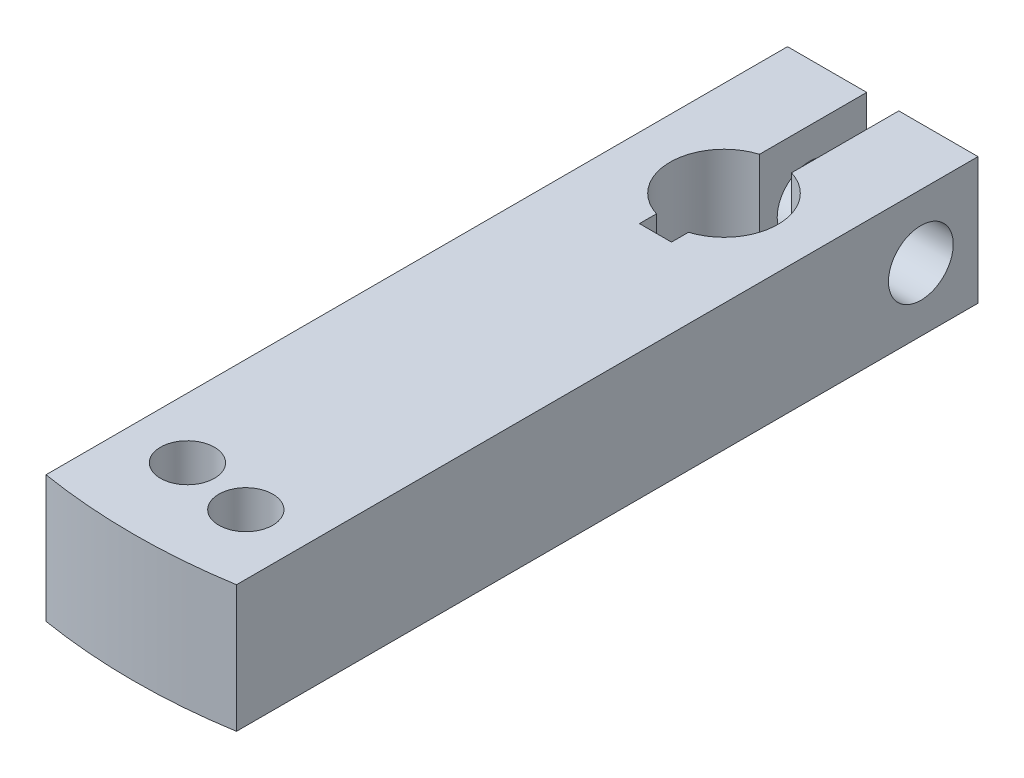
ISO-10303-21;
HEADER;
FILE_DESCRIPTION(('STEP AP214'),'2;1');
FILE_NAME('part.step','',(''),(''),'','','');
FILE_SCHEMA(('AUTOMOTIVE_DESIGN { 1 0 10303 214 1 1 1 1 }'));
ENDSEC;
DATA;
#1=APPLICATION_CONTEXT('core data for automotive mechanical design processes');
#2=APPLICATION_PROTOCOL_DEFINITION('international standard','automotive_design',2000,#1);
#3=PRODUCT_CONTEXT('',#1,'mechanical');
#4=PRODUCT('Part','Part','',(#3));
#5=PRODUCT_RELATED_PRODUCT_CATEGORY('part','',(#4));
#6=PRODUCT_DEFINITION_FORMATION('','',#4);
#7=PRODUCT_DEFINITION_CONTEXT('part definition',#1,'design');
#8=PRODUCT_DEFINITION('design','',#6,#7);
#9=PRODUCT_DEFINITION_SHAPE('','',#8);
#10=(LENGTH_UNIT() NAMED_UNIT(*) SI_UNIT(.MILLI.,.METRE.));
#11=(NAMED_UNIT(*) PLANE_ANGLE_UNIT() SI_UNIT($,.RADIAN.));
#12=(NAMED_UNIT(*) SI_UNIT($,.STERADIAN.) SOLID_ANGLE_UNIT());
#13=UNCERTAINTY_MEASURE_WITH_UNIT(LENGTH_MEASURE(1.E-05),#10,'distance_accuracy_value','');
#14=(GEOMETRIC_REPRESENTATION_CONTEXT(3) GLOBAL_UNCERTAINTY_ASSIGNED_CONTEXT((#13)) GLOBAL_UNIT_ASSIGNED_CONTEXT((#10,
#11,#12)) REPRESENTATION_CONTEXT('',''));
#15=CARTESIAN_POINT('',(0.,0.,0.));
#16=DIRECTION('',(0.,0.,1.));
#17=DIRECTION('',(1.,0.,0.));
#18=AXIS2_PLACEMENT_3D('',#15,#16,#17);
#19=CARTESIAN_POINT('',(15.0000000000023,-10.,-25.));
#20=DIRECTION('',(-1.,0.,0.));
#21=DIRECTION('',(0.,0.,1.));
#22=AXIS2_PLACEMENT_3D('',#19,#20,#21);
#23=PLANE('',#22);
#24=CARTESIAN_POINT('',(15.0000000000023,0.,-16.));
#25=DIRECTION('',(-1.,0.,0.));
#26=DIRECTION('',(0.,0.,1.));
#27=AXIS2_PLACEMENT_3D('',#24,#25,#26);
#28=CIRCLE('',#27,5.1);
#29=CARTESIAN_POINT('',(15.0000000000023,0.,-10.9));
#30=VERTEX_POINT('',#29);
#31=EDGE_CURVE('E140',#30,#30,#28,.T.);
#32=ORIENTED_EDGE('',*,*,#31,.T.);
#33=EDGE_LOOP('',(#32));
#34=FACE_BOUND('',#33,.T.);
#35=DIRECTION('',(0.,0.,1.));
#36=VECTOR('',#35,1.);
#37=CARTESIAN_POINT('',(15.0000000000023,9.99999999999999,-25.));
#38=LINE('',#37,#36);
#39=CARTESIAN_POINT('',(15.0000000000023,9.99999999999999,-25.));
#40=VERTEX_POINT('',#39);
#41=CARTESIAN_POINT('',(15.0000000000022,10.,91.7823512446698));
#42=VERTEX_POINT('',#41);
#43=EDGE_CURVE('E143',#40,#42,#38,.T.);
#44=ORIENTED_EDGE('',*,*,#43,.T.);
#45=DIRECTION('',(0.,1.,0.));
#46=VECTOR('',#45,1.);
#47=CARTESIAN_POINT('',(15.0000000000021,-10.,91.7823512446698));
#48=LINE('',#47,#46);
#49=CARTESIAN_POINT('',(15.0000000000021,-10.,91.7823512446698));
#50=VERTEX_POINT('',#49);
#51=EDGE_CURVE('E11',#50,#42,#48,.T.);
#52=ORIENTED_EDGE('',*,*,#51,.F.);
#53=DIRECTION('',(0.,0.,1.));
#54=VECTOR('',#53,1.);
#55=CARTESIAN_POINT('',(15.0000000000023,-10.,-25.));
#56=LINE('',#55,#54);
#57=CARTESIAN_POINT('',(15.0000000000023,-10.,-25.));
#58=VERTEX_POINT('',#57);
#59=EDGE_CURVE('E177',#58,#50,#56,.T.);
#60=ORIENTED_EDGE('',*,*,#59,.F.);
#61=DIRECTION('',(0.,1.,0.));
#62=VECTOR('',#61,1.);
#63=CARTESIAN_POINT('',(15.0000000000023,-10.,-25.));
#64=LINE('',#63,#62);
#65=EDGE_CURVE('E202',#58,#40,#64,.T.);
#66=ORIENTED_EDGE('',*,*,#65,.T.);
#67=EDGE_LOOP('',(#44,#52,#60,#66));
#68=FACE_BOUND('',#67,.T.);
#69=ADVANCED_FACE('F17',(#34,#68),#23,.F.);
#70=CARTESIAN_POINT('',(0.,-10.,0.));
#71=DIRECTION('',(0.,1.,0.));
#72=DIRECTION('',(0.,0.,1.));
#73=AXIS2_PLACEMENT_3D('',#70,#71,#72);
#74=CYLINDRICAL_SURFACE('',#73,93.);
#75=CARTESIAN_POINT('',(0.,9.99999999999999,0.));
#76=DIRECTION('',(0.,-1.,0.));
#77=DIRECTION('',(1.,0.,0.));
#78=AXIS2_PLACEMENT_3D('',#75,#76,#77);
#79=CIRCLE('',#78,93.);
#80=CARTESIAN_POINT('',(-14.999999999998,9.99999999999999,91.7823512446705));
#81=VERTEX_POINT('',#80);
#82=EDGE_CURVE('E144',#42,#81,#79,.T.);
#83=ORIENTED_EDGE('',*,*,#82,.T.);
#84=DIRECTION('',(0.,1.,0.));
#85=VECTOR('',#84,1.);
#86=CARTESIAN_POINT('',(-14.9999999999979,-10.,91.7823512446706));
#87=LINE('',#86,#85);
#88=CARTESIAN_POINT('',(-14.9999999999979,-10.,91.7823512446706));
#89=VERTEX_POINT('',#88);
#90=EDGE_CURVE('E25',#89,#81,#87,.T.);
#91=ORIENTED_EDGE('',*,*,#90,.F.);
#92=CARTESIAN_POINT('',(0.,-10.,0.));
#93=DIRECTION('',(0.,-1.,0.));
#94=DIRECTION('',(1.,0.,0.));
#95=AXIS2_PLACEMENT_3D('',#92,#93,#94);
#96=CIRCLE('',#95,93.);
#97=EDGE_CURVE('E181',#50,#89,#96,.T.);
#98=ORIENTED_EDGE('',*,*,#97,.F.);
#99=ORIENTED_EDGE('',*,*,#51,.T.);
#100=EDGE_LOOP('',(#83,#91,#98,#99));
#101=FACE_BOUND('',#100,.T.);
#102=ADVANCED_FACE('F259',(#101),#74,.T.);
#103=CARTESIAN_POINT('',(-14.9999999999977,-10.,-25.));
#104=DIRECTION('',(1.,0.,0.));
#105=DIRECTION('',(0.,0.,-1.));
#106=AXIS2_PLACEMENT_3D('',#103,#104,#105);
#107=PLANE('',#106);
#108=CARTESIAN_POINT('',(-14.9999999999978,0.,-15.9999999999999));
#109=DIRECTION('',(1.,0.,0.));
#110=DIRECTION('',(0.,0.,-1.));
#111=AXIS2_PLACEMENT_3D('',#108,#109,#110);
#112=CIRCLE('',#111,5.1);
#113=CARTESIAN_POINT('',(-14.9999999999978,0.,-21.0999999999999));
#114=VERTEX_POINT('',#113);
#115=EDGE_CURVE('E137',#114,#114,#112,.T.);
#116=ORIENTED_EDGE('',*,*,#115,.T.);
#117=EDGE_LOOP('',(#116));
#118=FACE_BOUND('',#117,.T.);
#119=DIRECTION('',(0.,0.,-1.));
#120=VECTOR('',#119,1.);
#121=CARTESIAN_POINT('',(-14.9999999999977,10.,-25.));
#122=LINE('',#121,#120);
#123=CARTESIAN_POINT('',(-14.9999999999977,10.,-25.));
#124=VERTEX_POINT('',#123);
#125=EDGE_CURVE('E147',#81,#124,#122,.T.);
#126=ORIENTED_EDGE('',*,*,#125,.T.);
#127=DIRECTION('',(0.,1.,0.));
#128=VECTOR('',#127,1.);
#129=CARTESIAN_POINT('',(-14.9999999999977,-10.,-25.));
#130=LINE('',#129,#128);
#131=CARTESIAN_POINT('',(-14.9999999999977,-10.,-25.));
#132=VERTEX_POINT('',#131);
#133=EDGE_CURVE('E230',#132,#124,#130,.T.);
#134=ORIENTED_EDGE('',*,*,#133,.F.);
#135=DIRECTION('',(0.,0.,-1.));
#136=VECTOR('',#135,1.);
#137=CARTESIAN_POINT('',(-14.9999999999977,-10.,-25.));
#138=LINE('',#137,#136);
#139=EDGE_CURVE('E183',#89,#132,#138,.T.);
#140=ORIENTED_EDGE('',*,*,#139,.F.);
#141=ORIENTED_EDGE('',*,*,#90,.T.);
#142=EDGE_LOOP('',(#126,#134,#140,#141));
#143=FACE_BOUND('',#142,.T.);
#144=ADVANCED_FACE('F238',(#118,#143),#107,.F.);
#145=CARTESIAN_POINT('',(-14.9999999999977,-10.,-25.));
#146=DIRECTION('',(0.,0.,1.));
#147=DIRECTION('',(1.,0.,0.));
#148=AXIS2_PLACEMENT_3D('',#145,#146,#147);
#149=PLANE('',#148);
#150=DIRECTION('',(1.,0.,0.));
#151=VECTOR('',#150,1.);
#152=CARTESIAN_POINT('',(-14.9999999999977,10.,-25.));
#153=LINE('',#152,#151);
#154=CARTESIAN_POINT('',(-2.525,10.,-25.));
#155=VERTEX_POINT('',#154);
#156=EDGE_CURVE('E150',#124,#155,#153,.T.);
#157=ORIENTED_EDGE('',*,*,#156,.T.);
#158=DIRECTION('',(0.,1.,0.));
#159=VECTOR('',#158,1.);
#160=CARTESIAN_POINT('',(-2.525,-9.99999999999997,-25.));
#161=LINE('',#160,#159);
#162=CARTESIAN_POINT('',(-2.525,-9.99999999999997,-25.));
#163=VERTEX_POINT('',#162);
#164=EDGE_CURVE('E227',#163,#155,#161,.T.);
#165=ORIENTED_EDGE('',*,*,#164,.F.);
#166=DIRECTION('',(1.,0.,0.));
#167=VECTOR('',#166,1.);
#168=CARTESIAN_POINT('',(-14.9999999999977,-10.,-25.));
#169=LINE('',#168,#167);
#170=EDGE_CURVE('E185',#132,#163,#169,.T.);
#171=ORIENTED_EDGE('',*,*,#170,.F.);
#172=ORIENTED_EDGE('',*,*,#133,.T.);
#173=EDGE_LOOP('',(#157,#165,#171,#172));
#174=FACE_BOUND('',#173,.T.);
#175=ADVANCED_FACE('F249',(#174),#149,.F.);
#176=CARTESIAN_POINT('',(-2.525,-9.99999999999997,-25.));
#177=DIRECTION('',(-1.,0.,0.));
#178=DIRECTION('',(0.,0.,1.));
#179=AXIS2_PLACEMENT_3D('',#176,#177,#178);
#180=PLANE('',#179);
#181=CARTESIAN_POINT('',(-2.525,0.,-16.));
#182=DIRECTION('',(-1.,0.,0.));
#183=DIRECTION('',(0.,0.,1.));
#184=AXIS2_PLACEMENT_3D('',#181,#182,#183);
#185=CIRCLE('',#184,5.1);
#186=CARTESIAN_POINT('',(-2.52500000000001,0.,-10.9));
#187=VERTEX_POINT('',#186);
#188=EDGE_CURVE('E134',#187,#187,#185,.T.);
#189=ORIENTED_EDGE('',*,*,#188,.T.);
#190=EDGE_LOOP('',(#189));
#191=FACE_BOUND('',#190,.T.);
#192=DIRECTION('',(0.,0.,1.));
#193=VECTOR('',#192,1.);
#194=CARTESIAN_POINT('',(-2.525,10.,-25.));
#195=LINE('',#194,#193);
#196=CARTESIAN_POINT('',(-2.525,9.99999999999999,-8.11630303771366));
#197=VERTEX_POINT('',#196);
#198=EDGE_CURVE('E153',#155,#197,#195,.T.);
#199=ORIENTED_EDGE('',*,*,#198,.T.);
#200=DIRECTION('',(0.,1.,0.));
#201=VECTOR('',#200,1.);
#202=CARTESIAN_POINT('',(-2.525,-10.,-8.11630303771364));
#203=LINE('',#202,#201);
#204=CARTESIAN_POINT('',(-2.525,-10.,-8.11630303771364));
#205=VERTEX_POINT('',#204);
#206=EDGE_CURVE('E224',#205,#197,#203,.T.);
#207=ORIENTED_EDGE('',*,*,#206,.F.);
#208=DIRECTION('',(0.,0.,1.));
#209=VECTOR('',#208,1.);
#210=CARTESIAN_POINT('',(-2.525,-9.99999999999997,-25.));
#211=LINE('',#210,#209);
#212=EDGE_CURVE('E187',#163,#205,#211,.T.);
#213=ORIENTED_EDGE('',*,*,#212,.F.);
#214=ORIENTED_EDGE('',*,*,#164,.T.);
#215=EDGE_LOOP('',(#199,#207,#213,#214));
#216=FACE_BOUND('',#215,.T.);
#217=ADVANCED_FACE('F253',(#191,#216),#180,.F.);
#218=CARTESIAN_POINT('',(0.,-10.,0.));
#219=DIRECTION('',(0.,1.,0.));
#220=DIRECTION('',(0.,0.,1.));
#221=AXIS2_PLACEMENT_3D('',#218,#219,#220);
#222=CYLINDRICAL_SURFACE('',#221,8.5);
#223=CARTESIAN_POINT('',(0.,9.99999999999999,0.));
#224=DIRECTION('',(0.,1.,0.));
#225=DIRECTION('',(1.,0.,0.));
#226=AXIS2_PLACEMENT_3D('',#223,#224,#225);
#227=CIRCLE('',#226,8.5);
#228=CARTESIAN_POINT('',(-2.52500000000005,10.,8.11630303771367));
#229=VERTEX_POINT('',#228);
#230=EDGE_CURVE('E156',#197,#229,#227,.T.);
#231=ORIENTED_EDGE('',*,*,#230,.T.);
#232=DIRECTION('',(0.,1.,0.));
#233=VECTOR('',#232,1.);
#234=CARTESIAN_POINT('',(-2.52500000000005,-10.,8.11630303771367));
#235=LINE('',#234,#233);
#236=CARTESIAN_POINT('',(-2.52500000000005,-10.,8.11630303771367));
#237=VERTEX_POINT('',#236);
#238=EDGE_CURVE('E221',#237,#229,#235,.T.);
#239=ORIENTED_EDGE('',*,*,#238,.F.);
#240=CARTESIAN_POINT('',(0.,-10.,0.));
#241=DIRECTION('',(0.,1.,0.));
#242=DIRECTION('',(1.,0.,0.));
#243=AXIS2_PLACEMENT_3D('',#240,#241,#242);
#244=CIRCLE('',#243,8.5);
#245=EDGE_CURVE('E189',#205,#237,#244,.T.);
#246=ORIENTED_EDGE('',*,*,#245,.F.);
#247=ORIENTED_EDGE('',*,*,#206,.T.);
#248=EDGE_LOOP('',(#231,#239,#246,#247));
#249=FACE_BOUND('',#248,.T.);
#250=ADVANCED_FACE('F290',(#249),#222,.F.);
#251=CARTESIAN_POINT('',(-2.52500000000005,-10.,10.8));
#252=DIRECTION('',(-1.,0.,0.));
#253=DIRECTION('',(0.,0.,1.));
#254=AXIS2_PLACEMENT_3D('',#251,#252,#253);
#255=PLANE('',#254);
#256=DIRECTION('',(0.,0.,1.));
#257=VECTOR('',#256,1.);
#258=CARTESIAN_POINT('',(-2.52500000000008,9.99999999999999,10.8));
#259=LINE('',#258,#257);
#260=CARTESIAN_POINT('',(-2.52500000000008,9.99999999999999,10.8));
#261=VERTEX_POINT('',#260);
#262=EDGE_CURVE('E159',#229,#261,#259,.T.);
#263=ORIENTED_EDGE('',*,*,#262,.T.);
#264=DIRECTION('',(0.,1.,0.));
#265=VECTOR('',#264,1.);
#266=CARTESIAN_POINT('',(-2.52500000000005,-10.,10.8));
#267=LINE('',#266,#265);
#268=CARTESIAN_POINT('',(-2.52500000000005,-10.,10.8));
#269=VERTEX_POINT('',#268);
#270=EDGE_CURVE('E218',#269,#261,#267,.T.);
#271=ORIENTED_EDGE('',*,*,#270,.F.);
#272=DIRECTION('',(0.,0.,1.));
#273=VECTOR('',#272,1.);
#274=CARTESIAN_POINT('',(-2.52500000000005,-10.,10.8));
#275=LINE('',#274,#273);
#276=EDGE_CURVE('E191',#237,#269,#275,.T.);
#277=ORIENTED_EDGE('',*,*,#276,.F.);
#278=ORIENTED_EDGE('',*,*,#238,.T.);
#279=EDGE_LOOP('',(#263,#271,#277,#278));
#280=FACE_BOUND('',#279,.T.);
#281=ADVANCED_FACE('F288',(#280),#255,.F.);
#282=CARTESIAN_POINT('',(-2.52500000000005,-10.,10.8));
#283=DIRECTION('',(0.,0.,1.));
#284=DIRECTION('',(1.,0.,0.));
#285=AXIS2_PLACEMENT_3D('',#282,#283,#284);
#286=PLANE('',#285);
#287=DIRECTION('',(1.,0.,0.));
#288=VECTOR('',#287,1.);
#289=CARTESIAN_POINT('',(-2.52500000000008,9.99999999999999,10.8));
#290=LINE('',#289,#288);
#291=CARTESIAN_POINT('',(2.52499999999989,9.99999999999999,10.8));
#292=VERTEX_POINT('',#291);
#293=EDGE_CURVE('E162',#261,#292,#290,.T.);
#294=ORIENTED_EDGE('',*,*,#293,.T.);
#295=DIRECTION('',(0.,1.,0.));
#296=VECTOR('',#295,1.);
#297=CARTESIAN_POINT('',(2.52499999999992,-10.,10.8));
#298=LINE('',#297,#296);
#299=CARTESIAN_POINT('',(2.52499999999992,-10.,10.8));
#300=VERTEX_POINT('',#299);
#301=EDGE_CURVE('E215',#300,#292,#298,.T.);
#302=ORIENTED_EDGE('',*,*,#301,.F.);
#303=DIRECTION('',(1.,0.,0.));
#304=VECTOR('',#303,1.);
#305=CARTESIAN_POINT('',(-2.52500000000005,-10.,10.8));
#306=LINE('',#305,#304);
#307=EDGE_CURVE('E193',#269,#300,#306,.T.);
#308=ORIENTED_EDGE('',*,*,#307,.F.);
#309=ORIENTED_EDGE('',*,*,#270,.T.);
#310=EDGE_LOOP('',(#294,#302,#308,#309));
#311=FACE_BOUND('',#310,.T.);
#312=ADVANCED_FACE('F284',(#311),#286,.F.);
#313=CARTESIAN_POINT('',(2.52499999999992,-10.,10.8));
#314=DIRECTION('',(1.,0.,0.));
#315=DIRECTION('',(0.,0.,-1.));
#316=AXIS2_PLACEMENT_3D('',#313,#314,#315);
#317=PLANE('',#316);
#318=DIRECTION('',(0.,0.,-1.));
#319=VECTOR('',#318,1.);
#320=CARTESIAN_POINT('',(2.52499999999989,9.99999999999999,10.8));
#321=LINE('',#320,#319);
#322=CARTESIAN_POINT('',(2.52499999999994,9.99999999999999,8.11630303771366));
#323=VERTEX_POINT('',#322);
#324=EDGE_CURVE('E165',#292,#323,#321,.T.);
#325=ORIENTED_EDGE('',*,*,#324,.T.);
#326=DIRECTION('',(0.,1.,0.));
#327=VECTOR('',#326,1.);
#328=CARTESIAN_POINT('',(2.52499999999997,-10.,8.11630303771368));
#329=LINE('',#328,#327);
#330=CARTESIAN_POINT('',(2.52499999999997,-10.,8.11630303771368));
#331=VERTEX_POINT('',#330);
#332=EDGE_CURVE('E212',#331,#323,#329,.T.);
#333=ORIENTED_EDGE('',*,*,#332,.F.);
#334=DIRECTION('',(0.,0.,-1.));
#335=VECTOR('',#334,1.);
#336=CARTESIAN_POINT('',(2.52499999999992,-10.,10.8));
#337=LINE('',#336,#335);
#338=EDGE_CURVE('E195',#300,#331,#337,.T.);
#339=ORIENTED_EDGE('',*,*,#338,.F.);
#340=ORIENTED_EDGE('',*,*,#301,.T.);
#341=EDGE_LOOP('',(#325,#333,#339,#340));
#342=FACE_BOUND('',#341,.T.);
#343=ADVANCED_FACE('F279',(#342),#317,.F.);
#344=CARTESIAN_POINT('',(0.,-10.,0.));
#345=DIRECTION('',(0.,1.,0.));
#346=DIRECTION('',(0.,0.,1.));
#347=AXIS2_PLACEMENT_3D('',#344,#345,#346);
#348=CYLINDRICAL_SURFACE('',#347,8.5);
#349=CARTESIAN_POINT('',(0.,9.99999999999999,0.));
#350=DIRECTION('',(0.,1.,0.));
#351=DIRECTION('',(-1.,0.,0.));
#352=AXIS2_PLACEMENT_3D('',#349,#350,#351);
#353=CIRCLE('',#352,8.5);
#354=CARTESIAN_POINT('',(2.525,9.99999999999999,-8.11630303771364));
#355=VERTEX_POINT('',#354);
#356=EDGE_CURVE('E168',#323,#355,#353,.T.);
#357=ORIENTED_EDGE('',*,*,#356,.T.);
#358=DIRECTION('',(0.,1.,0.));
#359=VECTOR('',#358,1.);
#360=CARTESIAN_POINT('',(2.525,-10.,-8.11630303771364));
#361=LINE('',#360,#359);
#362=CARTESIAN_POINT('',(2.525,-10.,-8.11630303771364));
#363=VERTEX_POINT('',#362);
#364=EDGE_CURVE('E209',#363,#355,#361,.T.);
#365=ORIENTED_EDGE('',*,*,#364,.F.);
#366=CARTESIAN_POINT('',(0.,-10.,0.));
#367=DIRECTION('',(0.,1.,0.));
#368=DIRECTION('',(-1.,0.,0.));
#369=AXIS2_PLACEMENT_3D('',#366,#367,#368);
#370=CIRCLE('',#369,8.5);
#371=EDGE_CURVE('E197',#331,#363,#370,.T.);
#372=ORIENTED_EDGE('',*,*,#371,.F.);
#373=ORIENTED_EDGE('',*,*,#332,.T.);
#374=EDGE_LOOP('',(#357,#365,#372,#373));
#375=FACE_BOUND('',#374,.T.);
#376=ADVANCED_FACE('F273',(#375),#348,.F.);
#377=CARTESIAN_POINT('',(2.525,-10.,-25.));
#378=DIRECTION('',(1.,0.,0.));
#379=DIRECTION('',(0.,0.,-1.));
#380=AXIS2_PLACEMENT_3D('',#377,#378,#379);
#381=PLANE('',#380);
#382=CARTESIAN_POINT('',(2.525,0.,-16.));
#383=DIRECTION('',(1.,0.,0.));
#384=DIRECTION('',(0.,0.,-1.));
#385=AXIS2_PLACEMENT_3D('',#382,#383,#384);
#386=CIRCLE('',#385,5.1);
#387=CARTESIAN_POINT('',(2.52500000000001,0.,-21.1));
#388=VERTEX_POINT('',#387);
#389=EDGE_CURVE('E20',#388,#388,#386,.T.);
#390=ORIENTED_EDGE('',*,*,#389,.T.);
#391=EDGE_LOOP('',(#390));
#392=FACE_BOUND('',#391,.T.);
#393=DIRECTION('',(0.,0.,-1.));
#394=VECTOR('',#393,1.);
#395=CARTESIAN_POINT('',(2.525,9.99999999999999,-25.));
#396=LINE('',#395,#394);
#397=CARTESIAN_POINT('',(2.525,9.99999999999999,-25.));
#398=VERTEX_POINT('',#397);
#399=EDGE_CURVE('E171',#355,#398,#396,.T.);
#400=ORIENTED_EDGE('',*,*,#399,.T.);
#401=DIRECTION('',(0.,1.,0.));
#402=VECTOR('',#401,1.);
#403=CARTESIAN_POINT('',(2.525,-10.,-25.));
#404=LINE('',#403,#402);
#405=CARTESIAN_POINT('',(2.525,-10.,-25.));
#406=VERTEX_POINT('',#405);
#407=EDGE_CURVE('E206',#406,#398,#404,.T.);
#408=ORIENTED_EDGE('',*,*,#407,.F.);
#409=DIRECTION('',(0.,0.,-1.));
#410=VECTOR('',#409,1.);
#411=CARTESIAN_POINT('',(2.525,-10.,-25.));
#412=LINE('',#411,#410);
#413=EDGE_CURVE('E199',#363,#406,#412,.T.);
#414=ORIENTED_EDGE('',*,*,#413,.F.);
#415=ORIENTED_EDGE('',*,*,#364,.T.);
#416=EDGE_LOOP('',(#400,#408,#414,#415));
#417=FACE_BOUND('',#416,.T.);
#418=ADVANCED_FACE('F269',(#392,#417),#381,.F.);
#419=CARTESIAN_POINT('',(2.525,-10.,-25.));
#420=DIRECTION('',(0.,0.,1.));
#421=DIRECTION('',(1.,0.,0.));
#422=AXIS2_PLACEMENT_3D('',#419,#420,#421);
#423=PLANE('',#422);
#424=DIRECTION('',(1.,0.,0.));
#425=VECTOR('',#424,1.);
#426=CARTESIAN_POINT('',(2.525,9.99999999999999,-25.));
#427=LINE('',#426,#425);
#428=EDGE_CURVE('E174',#398,#40,#427,.T.);
#429=ORIENTED_EDGE('',*,*,#428,.T.);
#430=ORIENTED_EDGE('',*,*,#65,.F.);
#431=DIRECTION('',(1.,0.,0.));
#432=VECTOR('',#431,1.);
#433=CARTESIAN_POINT('',(2.525,-10.,-25.));
#434=LINE('',#433,#432);
#435=EDGE_CURVE('E39',#406,#58,#434,.T.);
#436=ORIENTED_EDGE('',*,*,#435,.F.);
#437=ORIENTED_EDGE('',*,*,#407,.T.);
#438=EDGE_LOOP('',(#429,#430,#436,#437));
#439=FACE_BOUND('',#438,.T.);
#440=ADVANCED_FACE('F265',(#439),#423,.F.);
#441=CARTESIAN_POINT('',(0.,-10.,0.));
#442=DIRECTION('',(0.,-1.,0.));
#443=DIRECTION('',(0.,0.,-1.));
#444=AXIS2_PLACEMENT_3D('',#441,#442,#443);
#445=PLANE('',#444);
#446=CARTESIAN_POINT('',(-5.50000000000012,-10.,79.0087969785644));
#447=DIRECTION('',(0.,1.,0.));
#448=DIRECTION('',(0.,0.,1.));
#449=AXIS2_PLACEMENT_3D('',#446,#447,#448);
#450=CIRCLE('',#449,8.);
#451=CARTESIAN_POINT('',(0.928918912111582,-10.,74.2475994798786));
#452=VERTEX_POINT('',#451);
#453=CARTESIAN_POINT('',(-0.92891891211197,-10.,85.5742533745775));
#454=VERTEX_POINT('',#453);
#455=EDGE_CURVE('E31',#452,#454,#450,.T.);
#456=ORIENTED_EDGE('',*,*,#455,.T.);
#457=CARTESIAN_POINT('',(5.49999999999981,-10.,80.8130558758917));
#458=DIRECTION('',(0.,1.,0.));
#459=DIRECTION('',(0.,0.,1.));
#460=AXIS2_PLACEMENT_3D('',#457,#458,#459);
#461=CIRCLE('',#460,8.);
#462=EDGE_CURVE('E119',#454,#452,#461,.T.);
#463=ORIENTED_EDGE('',*,*,#462,.T.);
#464=EDGE_LOOP('',(#456,#463));
#465=FACE_BOUND('',#464,.T.);
#466=ORIENTED_EDGE('',*,*,#59,.T.);
#467=ORIENTED_EDGE('',*,*,#97,.T.);
#468=ORIENTED_EDGE('',*,*,#139,.T.);
#469=ORIENTED_EDGE('',*,*,#170,.T.);
#470=ORIENTED_EDGE('',*,*,#212,.T.);
#471=ORIENTED_EDGE('',*,*,#245,.T.);
#472=ORIENTED_EDGE('',*,*,#276,.T.);
#473=ORIENTED_EDGE('',*,*,#307,.T.);
#474=ORIENTED_EDGE('',*,*,#338,.T.);
#475=ORIENTED_EDGE('',*,*,#371,.T.);
#476=ORIENTED_EDGE('',*,*,#413,.T.);
#477=ORIENTED_EDGE('',*,*,#435,.T.);
#478=EDGE_LOOP('',(#466,#467,#468,#469,#470,#471,#472,#473,#474,#475,#476,#477));
#479=FACE_BOUND('',#478,.T.);
#480=ADVANCED_FACE('F118',(#465,#479),#445,.T.);
#481=CARTESIAN_POINT('',(0.,9.99999999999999,0.));
#482=DIRECTION('',(0.,-1.,0.));
#483=DIRECTION('',(0.,0.,-1.));
#484=AXIS2_PLACEMENT_3D('',#481,#482,#483);
#485=PLANE('',#484);
#486=CARTESIAN_POINT('',(-5.50000000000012,9.99999999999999,79.0087969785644));
#487=DIRECTION('',(0.,-1.,0.));
#488=DIRECTION('',(0.,0.,-1.));
#489=AXIS2_PLACEMENT_3D('',#486,#487,#488);
#490=CIRCLE('',#489,4.25);
#491=CARTESIAN_POINT('',(-5.50000000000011,9.99999999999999,74.7587969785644));
#492=VERTEX_POINT('',#491);
#493=EDGE_CURVE('E115',#492,#492,#490,.T.);
#494=ORIENTED_EDGE('',*,*,#493,.T.);
#495=EDGE_LOOP('',(#494));
#496=FACE_BOUND('',#495,.T.);
#497=CARTESIAN_POINT('',(5.49999999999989,9.99999999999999,80.8130558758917));
#498=DIRECTION('',(0.,-1.,0.));
#499=DIRECTION('',(0.,0.,-1.));
#500=AXIS2_PLACEMENT_3D('',#497,#498,#499);
#501=CIRCLE('',#500,4.25);
#502=CARTESIAN_POINT('',(5.4999999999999,9.99999999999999,76.5630558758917));
#503=VERTEX_POINT('',#502);
#504=EDGE_CURVE('E124',#503,#503,#501,.T.);
#505=ORIENTED_EDGE('',*,*,#504,.T.);
#506=EDGE_LOOP('',(#505));
#507=FACE_BOUND('',#506,.T.);
#508=ORIENTED_EDGE('',*,*,#43,.F.);
#509=ORIENTED_EDGE('',*,*,#428,.F.);
#510=ORIENTED_EDGE('',*,*,#399,.F.);
#511=ORIENTED_EDGE('',*,*,#356,.F.);
#512=ORIENTED_EDGE('',*,*,#324,.F.);
#513=ORIENTED_EDGE('',*,*,#293,.F.);
#514=ORIENTED_EDGE('',*,*,#262,.F.);
#515=ORIENTED_EDGE('',*,*,#230,.F.);
#516=ORIENTED_EDGE('',*,*,#198,.F.);
#517=ORIENTED_EDGE('',*,*,#156,.F.);
#518=ORIENTED_EDGE('',*,*,#125,.F.);
#519=ORIENTED_EDGE('',*,*,#82,.F.);
#520=EDGE_LOOP('',(#508,#509,#510,#511,#512,#513,#514,#515,#516,#517,#518,#519));
#521=FACE_BOUND('',#520,.T.);
#522=ADVANCED_FACE('F244',(#496,#507,#521),#485,.F.);
#523=CARTESIAN_POINT('',(0.,0.,-15.9999999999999));
#524=DIRECTION('',(1.,0.,0.));
#525=DIRECTION('',(0.,0.,1.));
#526=AXIS2_PLACEMENT_3D('',#523,#524,#525);
#527=CYLINDRICAL_SURFACE('',#526,5.1);
#528=ORIENTED_EDGE('',*,*,#389,.F.);
#529=EDGE_LOOP('',(#528));
#530=FACE_BOUND('',#529,.T.);
#531=ORIENTED_EDGE('',*,*,#31,.F.);
#532=EDGE_LOOP('',(#531));
#533=FACE_BOUND('',#532,.T.);
#534=ADVANCED_FACE('F308',(#530,#533),#527,.F.);
#535=ORIENTED_EDGE('',*,*,#188,.F.);
#536=EDGE_LOOP('',(#535));
#537=FACE_BOUND('',#536,.T.);
#538=ORIENTED_EDGE('',*,*,#115,.F.);
#539=EDGE_LOOP('',(#538));
#540=FACE_BOUND('',#539,.T.);
#541=ADVANCED_FACE('F310',(#537,#540),#527,.F.);
#542=CARTESIAN_POINT('',(5.49999999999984,117.135574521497,80.8130558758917));
#543=DIRECTION('',(0.,-1.,0.));
#544=DIRECTION('',(0.,0.,-1.));
#545=AXIS2_PLACEMENT_3D('',#542,#543,#544);
#546=CYLINDRICAL_SURFACE('',#545,4.25);
#547=ORIENTED_EDGE('',*,*,#504,.F.);
#548=EDGE_LOOP('',(#547));
#549=FACE_BOUND('',#548,.T.);
#550=CARTESIAN_POINT('',(5.49999999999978,-6.25,80.8130558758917));
#551=DIRECTION('',(0.,-1.,0.));
#552=DIRECTION('',(0.,0.,1.));
#553=AXIS2_PLACEMENT_3D('',#550,#551,#552);
#554=CIRCLE('',#553,4.25);
#555=CARTESIAN_POINT('',(5.49999999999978,-6.25,85.0630558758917));
#556=VERTEX_POINT('',#555);
#557=EDGE_CURVE('E125',#556,#556,#554,.T.);
#558=ORIENTED_EDGE('',*,*,#557,.T.);
#559=EDGE_LOOP('',(#558));
#560=FACE_BOUND('',#559,.T.);
#561=ADVANCED_FACE('F317',(#549,#560),#546,.F.);
#562=CARTESIAN_POINT('',(5.49999999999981,-10.,80.8130558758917));
#563=DIRECTION('',(0.,-1.,0.));
#564=DIRECTION('',(0.,0.,1.));
#565=AXIS2_PLACEMENT_3D('',#562,#563,#564);
#566=CONICAL_SURFACE('',#565,8.,0.785398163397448);
#567=ORIENTED_EDGE('',*,*,#462,.F.);
#568=CARTESIAN_POINT('',(-0.928964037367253,-10.0002,85.5745284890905));
#569=CARTESIAN_POINT('',(-0.903590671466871,-9.88777607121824,85.4198350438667));
#570=CARTESIAN_POINT('',(-0.878048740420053,-9.7767737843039,85.2641139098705));
#571=CARTESIAN_POINT('',(-0.826558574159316,-9.55828960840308,84.9501945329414));
#572=CARTESIAN_POINT('',(-0.80061017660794,-9.45080918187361,84.791995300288));
#573=CARTESIAN_POINT('',(-0.747948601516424,-9.23889168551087,84.4709342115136));
#574=CARTESIAN_POINT('',(-0.72123000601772,-9.13450573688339,84.3080393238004));
#575=CARTESIAN_POINT('',(-0.66726078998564,-8.93115243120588,83.9790059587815));
#576=CARTESIAN_POINT('',(-0.640010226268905,-8.83218449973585,83.8128678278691));
#577=CARTESIAN_POINT('',(-0.583868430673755,-8.63736393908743,83.4705889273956));
#578=CARTESIAN_POINT('',(-0.554953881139,-8.54176428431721,83.2943059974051));
#579=CARTESIAN_POINT('',(-0.496391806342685,-8.35960179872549,82.9372714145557));
#580=CARTESIAN_POINT('',(-0.466744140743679,-8.27304071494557,82.7565189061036));
#581=CARTESIAN_POINT('',(-0.376852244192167,-8.03109293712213,82.2084762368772));
#582=CARTESIAN_POINT('',(-0.315337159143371,-7.8922689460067,81.8334380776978));
#583=CARTESIAN_POINT('',(-0.222694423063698,-7.73808889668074,81.2686244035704));
#584=CARTESIAN_POINT('',(-0.192710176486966,-7.69626958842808,81.085819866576));
#585=CARTESIAN_POINT('',(-0.132223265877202,-7.63004318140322,80.7170501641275));
#586=CARTESIAN_POINT('',(-0.101720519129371,-7.60563888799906,80.5310844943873));
#587=CARTESIAN_POINT('',(-0.0409344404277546,-7.57613687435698,80.160490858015));
#588=CARTESIAN_POINT('',(-0.0106548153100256,-7.5707514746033,79.9758854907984));
#589=CARTESIAN_POINT('',(0.0498368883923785,-7.57886508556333,79.6070865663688));
#590=CARTESIAN_POINT('',(0.0800489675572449,-7.59236393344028,79.4228930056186));
#591=CARTESIAN_POINT('',(0.139953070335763,-7.6371859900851,79.0576764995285));
#592=CARTESIAN_POINT('',(0.169647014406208,-7.66841318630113,78.8766418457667));
#593=CARTESIAN_POINT('',(0.228477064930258,-7.74672303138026,78.5179734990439));
#594=CARTESIAN_POINT('',(0.257613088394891,-7.7938080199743,78.3403403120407));
#595=CARTESIAN_POINT('',(0.315629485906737,-7.90226553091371,77.9866325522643));
#596=CARTESIAN_POINT('',(0.344500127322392,-7.96383414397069,77.8106173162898));
#597=CARTESIAN_POINT('',(0.401521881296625,-8.09844531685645,77.4629735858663));
#598=CARTESIAN_POINT('',(0.429673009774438,-8.17148762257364,77.2913449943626));
#599=CARTESIAN_POINT('',(0.500058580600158,-8.3681480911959,76.8622262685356));
#600=CARTESIAN_POINT('',(0.541832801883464,-8.49802534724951,76.6075419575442));
#601=CARTESIAN_POINT('',(0.624015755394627,-8.77358167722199,76.106498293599));
#602=CARTESIAN_POINT('',(0.664423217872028,-8.9192749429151,75.8601466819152));
#603=CARTESIAN_POINT('',(0.723471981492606,-9.14377658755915,75.5001449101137));
#604=CARTESIAN_POINT('',(0.742557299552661,-9.21818618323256,75.3837877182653));
#605=CARTESIAN_POINT('',(0.780485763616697,-9.36933607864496,75.1525497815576));
#606=CARTESIAN_POINT('',(0.799328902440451,-9.44607644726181,75.037669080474));
#607=CARTESIAN_POINT('',(0.83675150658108,-9.60138586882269,74.8095152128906));
#608=CARTESIAN_POINT('',(0.855331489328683,-9.6799501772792,74.6962388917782));
#609=CARTESIAN_POINT('',(0.89229175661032,-9.83882512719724,74.4709037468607));
#610=CARTESIAN_POINT('',(0.910672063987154,-9.9191355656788,74.3588447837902));
#611=CARTESIAN_POINT('',(0.928964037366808,-10.0002,74.2473243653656));
#612=B_SPLINE_CURVE_WITH_KNOTS('',3,(#568,#569,#570,#571,#572,#573,#574,#575,#576,#577,#578,
#579,#580,#581,#582,#583,#584,#585,#586,#587,#588,#589,#590,#591,#592,#593,#594,#595,#596,#597,
#598,#599,#600,#601,#602,#603,#604,#605,#606,#607,#608,#609,#610,#611),.UNSPECIFIED.,.F.,.F.,(4,
2,2,2,2,2,2,2,2,2,2,2,2,2,2,2,2,2,2,2,2,4),(0.,0.578738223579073,1.15771379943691,
1.74354658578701,2.32931714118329,2.9368855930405,3.54457126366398,4.75304444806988,
5.3220990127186,5.89124522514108,6.45174476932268,7.01223948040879,7.56972725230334,
8.12729731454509,8.69290129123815,9.25849274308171,10.1244468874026,10.991184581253,
11.4094460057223,11.827719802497,12.2450062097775,12.6622443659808),.UNSPECIFIED.);
#613=EDGE_CURVE('E110',#454,#452,#612,.T.);
#614=ORIENTED_EDGE('',*,*,#613,.T.);
#615=EDGE_LOOP('',(#567,#614));
#616=FACE_BOUND('',#615,.T.);
#617=ORIENTED_EDGE('',*,*,#557,.F.);
#618=EDGE_LOOP('',(#617));
#619=FACE_BOUND('',#618,.T.);
#620=ADVANCED_FACE('F122',(#616,#619),#566,.F.);
#621=CARTESIAN_POINT('',(-5.50000000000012,117.135574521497,79.0087969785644));
#622=DIRECTION('',(0.,-1.,0.));
#623=DIRECTION('',(0.,0.,-1.));
#624=AXIS2_PLACEMENT_3D('',#621,#622,#623);
#625=CYLINDRICAL_SURFACE('',#624,4.25);
#626=ORIENTED_EDGE('',*,*,#493,.F.);
#627=EDGE_LOOP('',(#626));
#628=FACE_BOUND('',#627,.T.);
#629=CARTESIAN_POINT('',(-5.50000000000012,-6.25000000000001,79.0087969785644));
#630=DIRECTION('',(0.,-1.,0.));
#631=DIRECTION('',(0.,0.,1.));
#632=AXIS2_PLACEMENT_3D('',#629,#630,#631);
#633=CIRCLE('',#632,4.25);
#634=CARTESIAN_POINT('',(-5.50000000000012,-6.25000000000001,83.2587969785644));
#635=VERTEX_POINT('',#634);
#636=EDGE_CURVE('E120',#635,#635,#633,.T.);
#637=ORIENTED_EDGE('',*,*,#636,.T.);
#638=EDGE_LOOP('',(#637));
#639=FACE_BOUND('',#638,.T.);
#640=ADVANCED_FACE('F432',(#628,#639),#625,.F.);
#641=CARTESIAN_POINT('',(-5.50000000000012,-10.,79.0087969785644));
#642=DIRECTION('',(0.,-1.,0.));
#643=DIRECTION('',(0.,0.,1.));
#644=AXIS2_PLACEMENT_3D('',#641,#642,#643);
#645=CONICAL_SURFACE('',#644,8.,0.785398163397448);
#646=ORIENTED_EDGE('',*,*,#636,.F.);
#647=EDGE_LOOP('',(#646));
#648=FACE_BOUND('',#647,.T.);
#649=ORIENTED_EDGE('',*,*,#455,.F.);
#650=ORIENTED_EDGE('',*,*,#613,.F.);
#651=EDGE_LOOP('',(#649,#650));
#652=FACE_BOUND('',#651,.T.);
#653=ADVANCED_FACE('F111',(#648,#652),#645,.F.);
#654=CLOSED_SHELL('',(#69,#102,#144,#175,#217,#250,#281,#312,#343,#376,#418,#440,#480,#522,#534,
#541,#561,#620,#640,#653));
#655=MANIFOLD_SOLID_BREP('B1',#654);
#656=ADVANCED_BREP_SHAPE_REPRESENTATION('',(#18,#655),#14);
#657=SHAPE_DEFINITION_REPRESENTATION(#9,#656);
ENDSEC;
END-ISO-10303-21;
